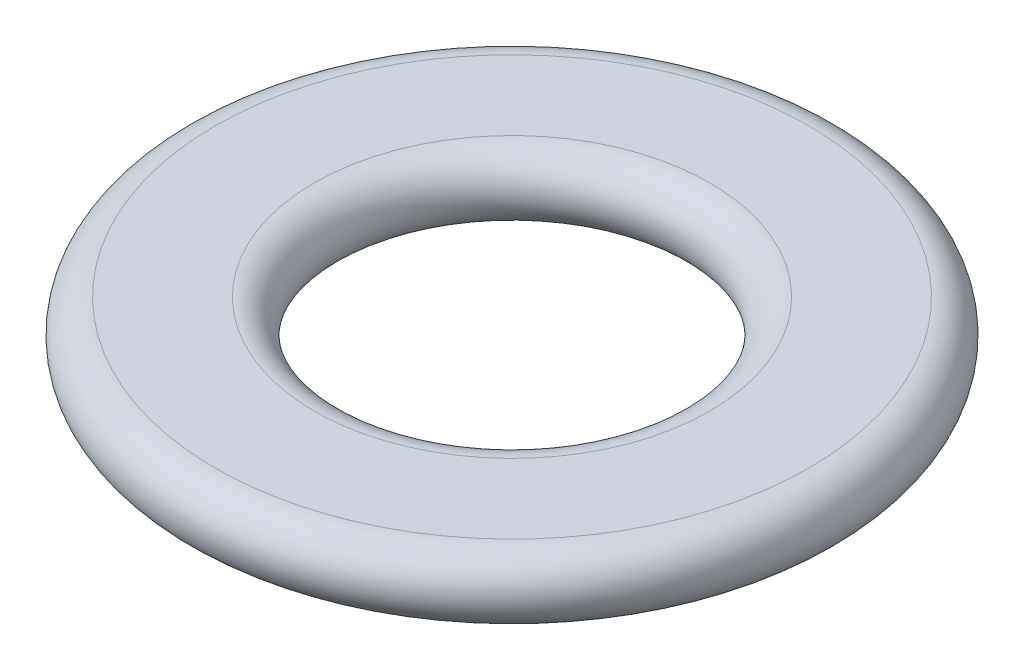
from build123d import *


with BuildPart() as part:
    # Esquisse1 → Base (revolve)
    with BuildSketch(Plane.XY, mode=Mode.PRIVATE) as base_sk:
        with BuildLine():
            Line((3, 0), (4.5, 0))
            ThreePointArc((4.5, 0), (5, 0.5), (4.5, 1))
            Line((4.5, 1), (3, 1))
            ThreePointArc((3, 1), (2.5, 0.5), (3, 0))
        make_face()
    revolve(base_sk.sketch.rotate(Axis((0, 1, 0), (0, -1, 0)), 180), axis=Axis((0, 1, 0), (0, -1, 0)))


solid = part.part
